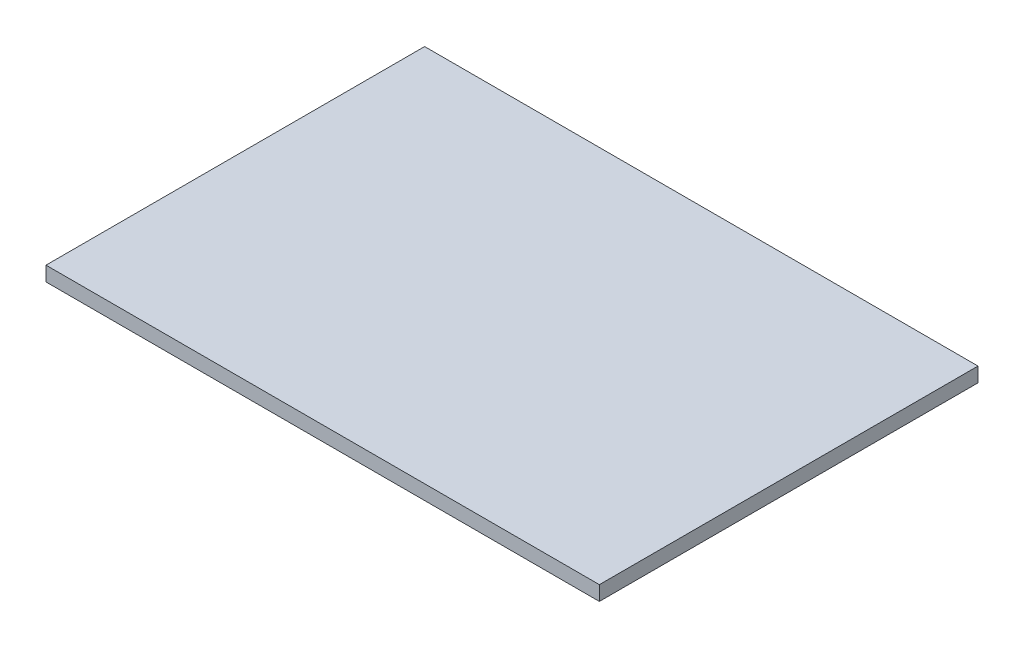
ISO-10303-21;
HEADER;
FILE_DESCRIPTION(('STEP AP214'),'2;1');
FILE_NAME('part.step','',(''),(''),'','','');
FILE_SCHEMA(('AUTOMOTIVE_DESIGN { 1 0 10303 214 1 1 1 1 }'));
ENDSEC;
DATA;
#1=APPLICATION_CONTEXT('core data for automotive mechanical design processes');
#2=APPLICATION_PROTOCOL_DEFINITION('international standard','automotive_design',2000,#1);
#3=PRODUCT_CONTEXT('',#1,'mechanical');
#4=PRODUCT('Part','Part','',(#3));
#5=PRODUCT_RELATED_PRODUCT_CATEGORY('part','',(#4));
#6=PRODUCT_DEFINITION_FORMATION('','',#4);
#7=PRODUCT_DEFINITION_CONTEXT('part definition',#1,'design');
#8=PRODUCT_DEFINITION('design','',#6,#7);
#9=PRODUCT_DEFINITION_SHAPE('','',#8);
#10=(LENGTH_UNIT() NAMED_UNIT(*) SI_UNIT(.MILLI.,.METRE.));
#11=(NAMED_UNIT(*) PLANE_ANGLE_UNIT() SI_UNIT($,.RADIAN.));
#12=(NAMED_UNIT(*) SI_UNIT($,.STERADIAN.) SOLID_ANGLE_UNIT());
#13=UNCERTAINTY_MEASURE_WITH_UNIT(LENGTH_MEASURE(1.E-05),#10,'distance_accuracy_value','');
#14=(GEOMETRIC_REPRESENTATION_CONTEXT(3) GLOBAL_UNCERTAINTY_ASSIGNED_CONTEXT((#13)) GLOBAL_UNIT_ASSIGNED_CONTEXT((#10,
#11,#12)) REPRESENTATION_CONTEXT('',''));
#15=CARTESIAN_POINT('',(0.,0.,0.));
#16=DIRECTION('',(0.,0.,1.));
#17=DIRECTION('',(1.,0.,0.));
#18=AXIS2_PLACEMENT_3D('',#15,#16,#17);
#19=CARTESIAN_POINT('',(-95.,5.,65.));
#20=DIRECTION('',(1.,0.,0.));
#21=DIRECTION('',(0.,0.,-1.));
#22=AXIS2_PLACEMENT_3D('',#19,#20,#21);
#23=PLANE('',#22);
#24=DIRECTION('',(0.,0.,1.));
#25=VECTOR('',#24,1.);
#26=CARTESIAN_POINT('',(-95.,0.,65.));
#27=LINE('',#26,#25);
#28=CARTESIAN_POINT('',(-95.,0.,-65.));
#29=VERTEX_POINT('',#28);
#30=CARTESIAN_POINT('',(-95.,0.,65.));
#31=VERTEX_POINT('',#30);
#32=EDGE_CURVE('E110',#29,#31,#27,.T.);
#33=ORIENTED_EDGE('',*,*,#32,.T.);
#34=DIRECTION('',(0.,-1.,0.));
#35=VECTOR('',#34,1.);
#36=CARTESIAN_POINT('',(-95.,5.,65.));
#37=LINE('',#36,#35);
#38=CARTESIAN_POINT('',(-95.,5.,65.));
#39=VERTEX_POINT('',#38);
#40=EDGE_CURVE('E11',#39,#31,#37,.T.);
#41=ORIENTED_EDGE('',*,*,#40,.F.);
#42=DIRECTION('',(0.,0.,1.));
#43=VECTOR('',#42,1.);
#44=CARTESIAN_POINT('',(-95.,5.,65.));
#45=LINE('',#44,#43);
#46=CARTESIAN_POINT('',(-95.,5.,-65.));
#47=VERTEX_POINT('',#46);
#48=EDGE_CURVE('E98',#47,#39,#45,.T.);
#49=ORIENTED_EDGE('',*,*,#48,.F.);
#50=DIRECTION('',(0.,-1.,0.));
#51=VECTOR('',#50,1.);
#52=CARTESIAN_POINT('',(-95.,5.,-65.));
#53=LINE('',#52,#51);
#54=EDGE_CURVE('E106',#47,#29,#53,.T.);
#55=ORIENTED_EDGE('',*,*,#54,.T.);
#56=EDGE_LOOP('',(#33,#41,#49,#55));
#57=FACE_BOUND('',#56,.T.);
#58=ADVANCED_FACE('F47',(#57),#23,.F.);
#59=CARTESIAN_POINT('',(95.,5.,65.));
#60=DIRECTION('',(0.,0.,-1.));
#61=DIRECTION('',(-1.,0.,0.));
#62=AXIS2_PLACEMENT_3D('',#59,#60,#61);
#63=PLANE('',#62);
#64=DIRECTION('',(1.,0.,0.));
#65=VECTOR('',#64,1.);
#66=CARTESIAN_POINT('',(95.,0.,65.));
#67=LINE('',#66,#65);
#68=CARTESIAN_POINT('',(95.,0.,65.));
#69=VERTEX_POINT('',#68);
#70=EDGE_CURVE('E102',#31,#69,#67,.T.);
#71=ORIENTED_EDGE('',*,*,#70,.T.);
#72=DIRECTION('',(0.,-1.,0.));
#73=VECTOR('',#72,1.);
#74=CARTESIAN_POINT('',(95.,5.,65.));
#75=LINE('',#74,#73);
#76=CARTESIAN_POINT('',(95.,5.,65.));
#77=VERTEX_POINT('',#76);
#78=EDGE_CURVE('E55',#77,#69,#75,.T.);
#79=ORIENTED_EDGE('',*,*,#78,.F.);
#80=DIRECTION('',(1.,0.,0.));
#81=VECTOR('',#80,1.);
#82=CARTESIAN_POINT('',(95.,5.,65.));
#83=LINE('',#82,#81);
#84=EDGE_CURVE('E93',#39,#77,#83,.T.);
#85=ORIENTED_EDGE('',*,*,#84,.F.);
#86=ORIENTED_EDGE('',*,*,#40,.T.);
#87=EDGE_LOOP('',(#71,#79,#85,#86));
#88=FACE_BOUND('',#87,.T.);
#89=ADVANCED_FACE('F101',(#88),#63,.F.);
#90=CARTESIAN_POINT('',(95.,5.,65.));
#91=DIRECTION('',(-1.,0.,0.));
#92=DIRECTION('',(0.,0.,1.));
#93=AXIS2_PLACEMENT_3D('',#90,#91,#92);
#94=PLANE('',#93);
#95=DIRECTION('',(0.,0.,-1.));
#96=VECTOR('',#95,1.);
#97=CARTESIAN_POINT('',(95.,0.,65.));
#98=LINE('',#97,#96);
#99=CARTESIAN_POINT('',(95.,0.,-65.0000000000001));
#100=VERTEX_POINT('',#99);
#101=EDGE_CURVE('E80',#69,#100,#98,.T.);
#102=ORIENTED_EDGE('',*,*,#101,.T.);
#103=DIRECTION('',(0.,-1.,0.));
#104=VECTOR('',#103,1.);
#105=CARTESIAN_POINT('',(95.,5.,-65.0000000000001));
#106=LINE('',#105,#104);
#107=CARTESIAN_POINT('',(95.,5.,-65.0000000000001));
#108=VERTEX_POINT('',#107);
#109=EDGE_CURVE('E103',#108,#100,#106,.T.);
#110=ORIENTED_EDGE('',*,*,#109,.F.);
#111=DIRECTION('',(0.,0.,-1.));
#112=VECTOR('',#111,1.);
#113=CARTESIAN_POINT('',(95.,5.,65.));
#114=LINE('',#113,#112);
#115=EDGE_CURVE('E96',#77,#108,#114,.T.);
#116=ORIENTED_EDGE('',*,*,#115,.F.);
#117=ORIENTED_EDGE('',*,*,#78,.T.);
#118=EDGE_LOOP('',(#102,#110,#116,#117));
#119=FACE_BOUND('',#118,.T.);
#120=ADVANCED_FACE('F104',(#119),#94,.F.);
#121=CARTESIAN_POINT('',(95.,5.,-65.0000000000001));
#122=DIRECTION('',(0.,0.,1.));
#123=DIRECTION('',(1.,0.,0.));
#124=AXIS2_PLACEMENT_3D('',#121,#122,#123);
#125=PLANE('',#124);
#126=DIRECTION('',(-1.,0.,0.));
#127=VECTOR('',#126,1.);
#128=CARTESIAN_POINT('',(95.,0.,-65.0000000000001));
#129=LINE('',#128,#127);
#130=EDGE_CURVE('E86',#100,#29,#129,.T.);
#131=ORIENTED_EDGE('',*,*,#130,.T.);
#132=ORIENTED_EDGE('',*,*,#54,.F.);
#133=DIRECTION('',(-1.,0.,0.));
#134=VECTOR('',#133,1.);
#135=CARTESIAN_POINT('',(95.,5.,-65.0000000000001));
#136=LINE('',#135,#134);
#137=EDGE_CURVE('E63',#108,#47,#136,.T.);
#138=ORIENTED_EDGE('',*,*,#137,.F.);
#139=ORIENTED_EDGE('',*,*,#109,.T.);
#140=EDGE_LOOP('',(#131,#132,#138,#139));
#141=FACE_BOUND('',#140,.T.);
#142=ADVANCED_FACE('F117',(#141),#125,.F.);
#143=CARTESIAN_POINT('',(0.,5.,0.));
#144=DIRECTION('',(0.,1.,0.));
#145=DIRECTION('',(0.,0.,1.));
#146=AXIS2_PLACEMENT_3D('',#143,#144,#145);
#147=PLANE('',#146);
#148=ORIENTED_EDGE('',*,*,#48,.T.);
#149=ORIENTED_EDGE('',*,*,#84,.T.);
#150=ORIENTED_EDGE('',*,*,#115,.T.);
#151=ORIENTED_EDGE('',*,*,#137,.T.);
#152=EDGE_LOOP('',(#148,#149,#150,#151));
#153=FACE_BOUND('',#152,.T.);
#154=ADVANCED_FACE('F94',(#153),#147,.T.);
#155=CARTESIAN_POINT('',(0.,0.,0.));
#156=DIRECTION('',(0.,1.,0.));
#157=DIRECTION('',(0.,0.,1.));
#158=AXIS2_PLACEMENT_3D('',#155,#156,#157);
#159=PLANE('',#158);
#160=ORIENTED_EDGE('',*,*,#32,.F.);
#161=ORIENTED_EDGE('',*,*,#130,.F.);
#162=ORIENTED_EDGE('',*,*,#101,.F.);
#163=ORIENTED_EDGE('',*,*,#70,.F.);
#164=EDGE_LOOP('',(#160,#161,#162,#163));
#165=FACE_BOUND('',#164,.T.);
#166=ADVANCED_FACE('F120',(#165),#159,.F.);
#167=CLOSED_SHELL('',(#58,#89,#120,#142,#154,#166));
#168=MANIFOLD_SOLID_BREP('B2',#167);
#169=ADVANCED_BREP_SHAPE_REPRESENTATION('',(#18,#168),#14);
#170=SHAPE_DEFINITION_REPRESENTATION(#9,#169);
ENDSEC;
END-ISO-10303-21;
